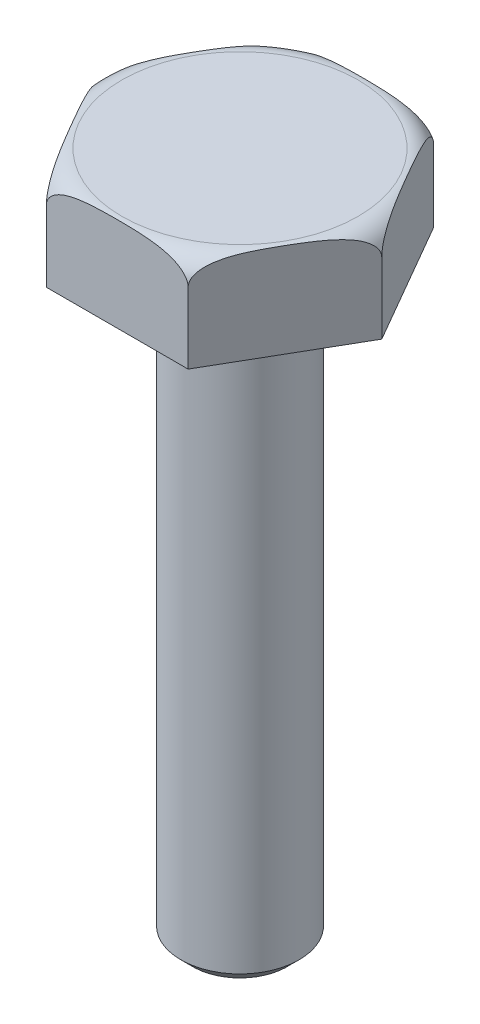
from build123d import *

# Parameters (mm, degrees)
BOSS_EXTRUDE1_DEPTH = 16
SKETCH2_R           = 10
BOSS_EXTRUDE2_DEPTH = 100
CHAMFER1_SIZE       = 2


with BuildPart() as part:
    # Sketch1 → Boss-Extrude1 (new body)
    with BuildSketch(Plane(origin=(0, 0, 0), x_dir=(1, 0, 0), z_dir=(0, 1, 0))):
        Polygon((24, 0), (12, 20.784609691), (-12, 20.784609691), (-24, 0), (-12, -20.784609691), (12, -20.784609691), align=None)
    extrude(amount=BOSS_EXTRUDE1_DEPTH)

    # Sketch2 → Boss-Extrude2 (add)
    with BuildSketch(Plane.XZ):
        with Locations(Location((0, 0, 0), (0, 0, 270))):
            Circle(SKETCH2_R)
    extrude(amount=BOSS_EXTRUDE2_DEPTH)

    # Chamfer1
    chamfer1_edges = [part.edges().sort_by_distance(p)[0] for p in [
        (0, -100, 10),
    ]]
    chamfer(chamfer1_edges, length=CHAMFER1_SIZE)

    # Sketch4 → Cut-Revolve1 (revolve, cut)
    with BuildSketch(Plane.XY, mode=Mode.PRIVATE) as cut_revolve1_sk:
        with BuildLine():
            Line((20, 16), (24, 16))
            Line((24, 16), (24, 12))
            ThreePointArc((24, 12), (22.828427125, 14.828427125), (20, 16))
        make_face()
    revolve(cut_revolve1_sk.sketch.rotate(Axis((0, -100, 0), (0, 1, 0)), 90), axis=Axis((0, -100, 0), (0, 1, 0)), mode=Mode.SUBTRACT)


solid = part.part
